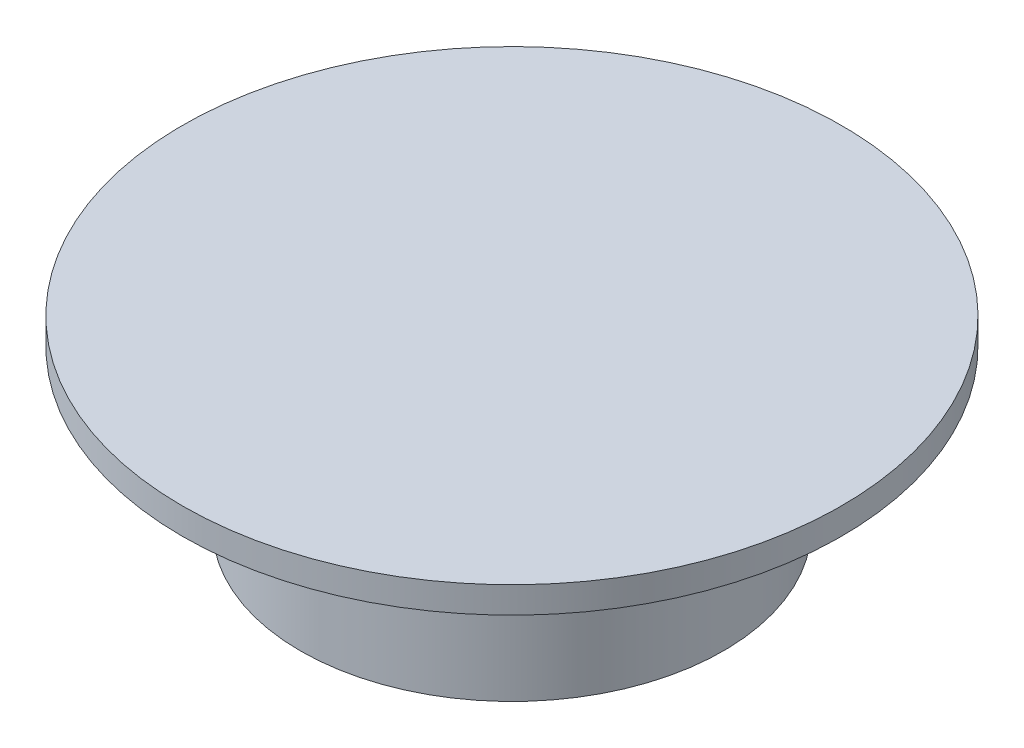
from build123d import *


with BuildPart() as part:
    # Sketch1 → Revolve1 (revolve)
    with BuildSketch(Plane.XY, mode=Mode.PRIVATE) as revolve1_sk:
        Polygon((0, 7), (0, -7), (16.05, -7), (16.05, 2), (25, 5), (25, 7), align=None)
    revolve(revolve1_sk.sketch.rotate(Axis((0, 7, 0), (0, -1, 0)), 90), axis=Axis((0, 7, 0), (0, -1, 0)))


solid = part.part
